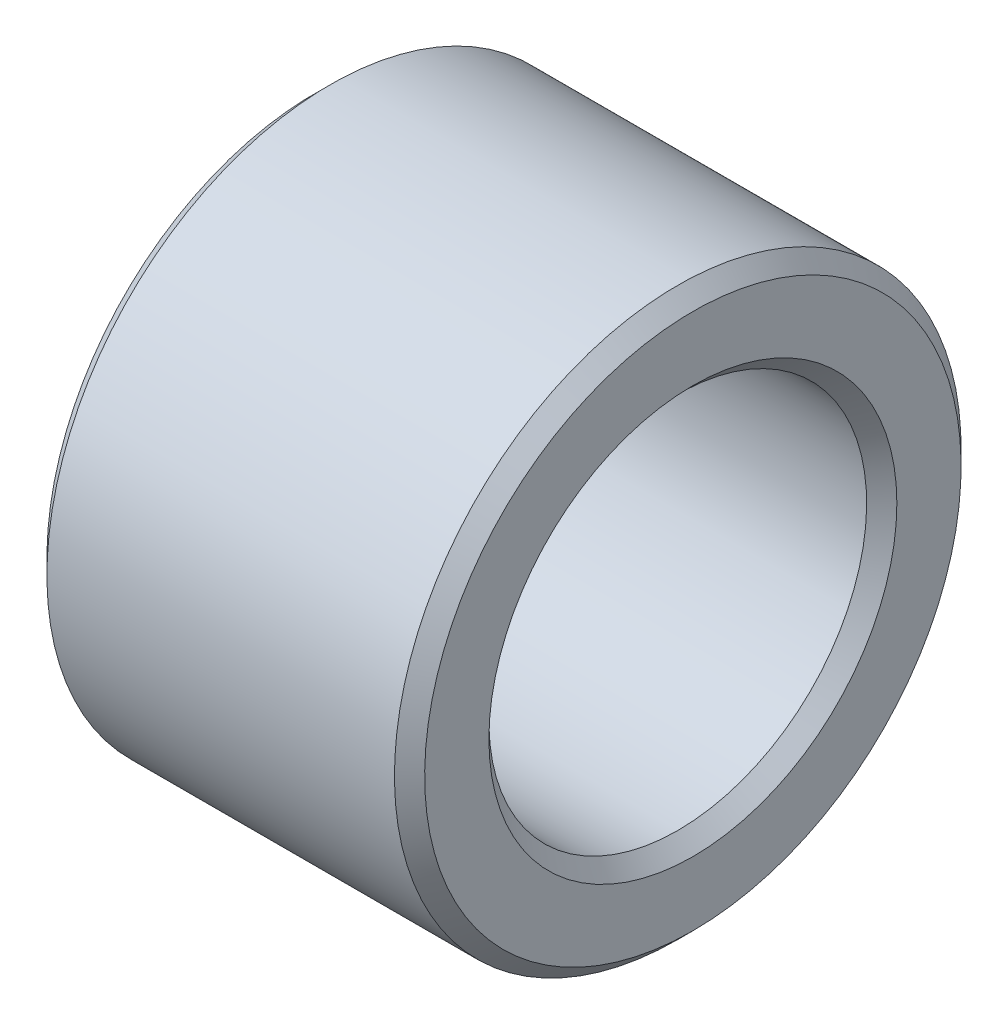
ISO-10303-21;
HEADER;
FILE_DESCRIPTION(('STEP AP214'),'2;1');
FILE_NAME('part.step','',(''),(''),'','','');
FILE_SCHEMA(('AUTOMOTIVE_DESIGN { 1 0 10303 214 1 1 1 1 }'));
ENDSEC;
DATA;
#1=APPLICATION_CONTEXT('core data for automotive mechanical design processes');
#2=APPLICATION_PROTOCOL_DEFINITION('international standard','automotive_design',2000,#1);
#3=PRODUCT_CONTEXT('',#1,'mechanical');
#4=PRODUCT('Part','Part','',(#3));
#5=PRODUCT_RELATED_PRODUCT_CATEGORY('part','',(#4));
#6=PRODUCT_DEFINITION_FORMATION('','',#4);
#7=PRODUCT_DEFINITION_CONTEXT('part definition',#1,'design');
#8=PRODUCT_DEFINITION('design','',#6,#7);
#9=PRODUCT_DEFINITION_SHAPE('','',#8);
#10=(LENGTH_UNIT() NAMED_UNIT(*) SI_UNIT(.MILLI.,.METRE.));
#11=(NAMED_UNIT(*) PLANE_ANGLE_UNIT() SI_UNIT($,.RADIAN.));
#12=(NAMED_UNIT(*) SI_UNIT($,.STERADIAN.) SOLID_ANGLE_UNIT());
#13=UNCERTAINTY_MEASURE_WITH_UNIT(LENGTH_MEASURE(1.E-05),#10,'distance_accuracy_value','');
#14=(GEOMETRIC_REPRESENTATION_CONTEXT(3) GLOBAL_UNCERTAINTY_ASSIGNED_CONTEXT((#13)) GLOBAL_UNIT_ASSIGNED_CONTEXT((#10,
#11,#12)) REPRESENTATION_CONTEXT('',''));
#15=CARTESIAN_POINT('',(0.,0.,0.));
#16=DIRECTION('',(0.,0.,1.));
#17=DIRECTION('',(1.,0.,0.));
#18=AXIS2_PLACEMENT_3D('',#15,#16,#17);
#19=CARTESIAN_POINT('',(0.,-6.25,0.));
#20=DIRECTION('',(-1.,0.,0.));
#21=DIRECTION('',(0.,1.,0.));
#22=AXIS2_PLACEMENT_3D('',#19,#20,#21);
#23=PLANE('',#22);
#24=CARTESIAN_POINT('',(0.,0.,0.));
#25=DIRECTION('',(1.,0.,0.));
#26=DIRECTION('',(0.,-1.,0.));
#27=AXIS2_PLACEMENT_3D('',#24,#25,#26);
#28=CIRCLE('',#27,5.4);
#29=CARTESIAN_POINT('',(0.,-5.4,0.));
#30=VERTEX_POINT('',#29);
#31=EDGE_CURVE('E9',#30,#30,#28,.T.);
#32=ORIENTED_EDGE('',*,*,#31,.T.);
#33=EDGE_LOOP('',(#32));
#34=FACE_BOUND('',#33,.T.);
#35=CARTESIAN_POINT('',(0.,0.,0.));
#36=DIRECTION('',(1.,0.,0.));
#37=DIRECTION('',(0.,-1.,0.));
#38=AXIS2_PLACEMENT_3D('',#35,#36,#37);
#39=CIRCLE('',#38,7.1);
#40=CARTESIAN_POINT('',(0.,-7.1,0.));
#41=VERTEX_POINT('',#40);
#42=EDGE_CURVE('E61',#41,#41,#39,.T.);
#43=ORIENTED_EDGE('',*,*,#42,.F.);
#44=EDGE_LOOP('',(#43));
#45=FACE_BOUND('',#44,.T.);
#46=ADVANCED_FACE('F15',(#34,#45),#23,.T.);
#47=CARTESIAN_POINT('',(0.2,0.,0.));
#48=DIRECTION('',(-1.,0.,0.));
#49=DIRECTION('',(0.,-1.,0.));
#50=AXIS2_PLACEMENT_3D('',#47,#48,#49);
#51=CONICAL_SURFACE('',#50,5.2,0.785398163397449);
#52=CARTESIAN_POINT('',(0.4,0.,0.));
#53=DIRECTION('',(1.,0.,0.));
#54=DIRECTION('',(0.,-1.,0.));
#55=AXIS2_PLACEMENT_3D('',#52,#53,#54);
#56=CIRCLE('',#55,5.);
#57=CARTESIAN_POINT('',(0.4,-5.,0.));
#58=VERTEX_POINT('',#57);
#59=EDGE_CURVE('E24',#58,#58,#56,.T.);
#60=ORIENTED_EDGE('',*,*,#59,.T.);
#61=EDGE_LOOP('',(#60));
#62=FACE_BOUND('',#61,.T.);
#63=ORIENTED_EDGE('',*,*,#31,.F.);
#64=EDGE_LOOP('',(#63));
#65=FACE_BOUND('',#64,.T.);
#66=ADVANCED_FACE('F86',(#62,#65),#51,.F.);
#67=CARTESIAN_POINT('',(5.,0.,0.));
#68=DIRECTION('',(-1.,0.,0.));
#69=DIRECTION('',(0.,-1.,0.));
#70=AXIS2_PLACEMENT_3D('',#67,#68,#69);
#71=CYLINDRICAL_SURFACE('',#70,5.);
#72=CARTESIAN_POINT('',(9.6,0.,0.));
#73=DIRECTION('',(1.,0.,0.));
#74=DIRECTION('',(0.,-1.,0.));
#75=AXIS2_PLACEMENT_3D('',#72,#73,#74);
#76=CIRCLE('',#75,5.);
#77=CARTESIAN_POINT('',(9.6,-5.,0.));
#78=VERTEX_POINT('',#77);
#79=EDGE_CURVE('E48',#78,#78,#76,.T.);
#80=ORIENTED_EDGE('',*,*,#79,.T.);
#81=EDGE_LOOP('',(#80));
#82=FACE_BOUND('',#81,.T.);
#83=ORIENTED_EDGE('',*,*,#59,.F.);
#84=EDGE_LOOP('',(#83));
#85=FACE_BOUND('',#84,.T.);
#86=ADVANCED_FACE('F90',(#82,#85),#71,.F.);
#87=CARTESIAN_POINT('',(9.8,0.,0.));
#88=DIRECTION('',(1.,0.,0.));
#89=DIRECTION('',(0.,-1.,0.));
#90=AXIS2_PLACEMENT_3D('',#87,#88,#89);
#91=CONICAL_SURFACE('',#90,5.2,0.785398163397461);
#92=CARTESIAN_POINT('',(10.,0.,0.));
#93=DIRECTION('',(1.,0.,0.));
#94=DIRECTION('',(0.,-1.,0.));
#95=AXIS2_PLACEMENT_3D('',#92,#93,#94);
#96=CIRCLE('',#95,5.4);
#97=CARTESIAN_POINT('',(10.,-5.4,0.));
#98=VERTEX_POINT('',#97);
#99=EDGE_CURVE('E52',#98,#98,#96,.T.);
#100=ORIENTED_EDGE('',*,*,#99,.T.);
#101=EDGE_LOOP('',(#100));
#102=FACE_BOUND('',#101,.T.);
#103=ORIENTED_EDGE('',*,*,#79,.F.);
#104=EDGE_LOOP('',(#103));
#105=FACE_BOUND('',#104,.T.);
#106=ADVANCED_FACE('F53',(#102,#105),#91,.F.);
#107=CARTESIAN_POINT('',(10.,-6.25,0.));
#108=DIRECTION('',(1.,0.,0.));
#109=DIRECTION('',(0.,-1.,0.));
#110=AXIS2_PLACEMENT_3D('',#107,#108,#109);
#111=PLANE('',#110);
#112=CARTESIAN_POINT('',(10.,0.,0.));
#113=DIRECTION('',(1.,0.,0.));
#114=DIRECTION('',(0.,-1.,0.));
#115=AXIS2_PLACEMENT_3D('',#112,#113,#114);
#116=CIRCLE('',#115,7.1);
#117=CARTESIAN_POINT('',(10.,-7.1,0.));
#118=VERTEX_POINT('',#117);
#119=EDGE_CURVE('E18',#118,#118,#116,.T.);
#120=ORIENTED_EDGE('',*,*,#119,.T.);
#121=EDGE_LOOP('',(#120));
#122=FACE_BOUND('',#121,.T.);
#123=ORIENTED_EDGE('',*,*,#99,.F.);
#124=EDGE_LOOP('',(#123));
#125=FACE_BOUND('',#124,.T.);
#126=ADVANCED_FACE('F81',(#122,#125),#111,.T.);
#127=CARTESIAN_POINT('',(9.8,0.,0.));
#128=DIRECTION('',(-1.,0.,0.));
#129=DIRECTION('',(0.,-1.,0.));
#130=AXIS2_PLACEMENT_3D('',#127,#128,#129);
#131=CONICAL_SURFACE('',#130,7.3,0.785398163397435);
#132=CARTESIAN_POINT('',(9.6,0.,0.));
#133=DIRECTION('',(1.,0.,0.));
#134=DIRECTION('',(0.,-1.,0.));
#135=AXIS2_PLACEMENT_3D('',#132,#133,#134);
#136=CIRCLE('',#135,7.5);
#137=CARTESIAN_POINT('',(9.6,-7.5,0.));
#138=VERTEX_POINT('',#137);
#139=EDGE_CURVE('E58',#138,#138,#136,.T.);
#140=ORIENTED_EDGE('',*,*,#139,.T.);
#141=EDGE_LOOP('',(#140));
#142=FACE_BOUND('',#141,.T.);
#143=ORIENTED_EDGE('',*,*,#119,.F.);
#144=EDGE_LOOP('',(#143));
#145=FACE_BOUND('',#144,.T.);
#146=ADVANCED_FACE('F66',(#142,#145),#131,.T.);
#147=CARTESIAN_POINT('',(5.,0.,0.));
#148=DIRECTION('',(-1.,0.,0.));
#149=DIRECTION('',(0.,-1.,0.));
#150=AXIS2_PLACEMENT_3D('',#147,#148,#149);
#151=CYLINDRICAL_SURFACE('',#150,7.5);
#152=CARTESIAN_POINT('',(0.4,0.,0.));
#153=DIRECTION('',(1.,0.,0.));
#154=DIRECTION('',(0.,-1.,0.));
#155=AXIS2_PLACEMENT_3D('',#152,#153,#154);
#156=CIRCLE('',#155,7.5);
#157=CARTESIAN_POINT('',(0.4,-7.5,0.));
#158=VERTEX_POINT('',#157);
#159=EDGE_CURVE('E60',#158,#158,#156,.T.);
#160=ORIENTED_EDGE('',*,*,#159,.T.);
#161=EDGE_LOOP('',(#160));
#162=FACE_BOUND('',#161,.T.);
#163=ORIENTED_EDGE('',*,*,#139,.F.);
#164=EDGE_LOOP('',(#163));
#165=FACE_BOUND('',#164,.T.);
#166=ADVANCED_FACE('F69',(#162,#165),#151,.T.);
#167=CARTESIAN_POINT('',(0.2,0.,0.));
#168=DIRECTION('',(1.,0.,0.));
#169=DIRECTION('',(0.,-1.,0.));
#170=AXIS2_PLACEMENT_3D('',#167,#168,#169);
#171=CONICAL_SURFACE('',#170,7.3,0.785398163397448);
#172=ORIENTED_EDGE('',*,*,#42,.T.);
#173=EDGE_LOOP('',(#172));
#174=FACE_BOUND('',#173,.T.);
#175=ORIENTED_EDGE('',*,*,#159,.F.);
#176=EDGE_LOOP('',(#175));
#177=FACE_BOUND('',#176,.T.);
#178=ADVANCED_FACE('F71',(#174,#177),#171,.T.);
#179=CLOSED_SHELL('',(#46,#66,#86,#106,#126,#146,#166,#178));
#180=MANIFOLD_SOLID_BREP('B1',#179);
#181=ADVANCED_BREP_SHAPE_REPRESENTATION('',(#18,#180),#14);
#182=SHAPE_DEFINITION_REPRESENTATION(#9,#181);
ENDSEC;
END-ISO-10303-21;
